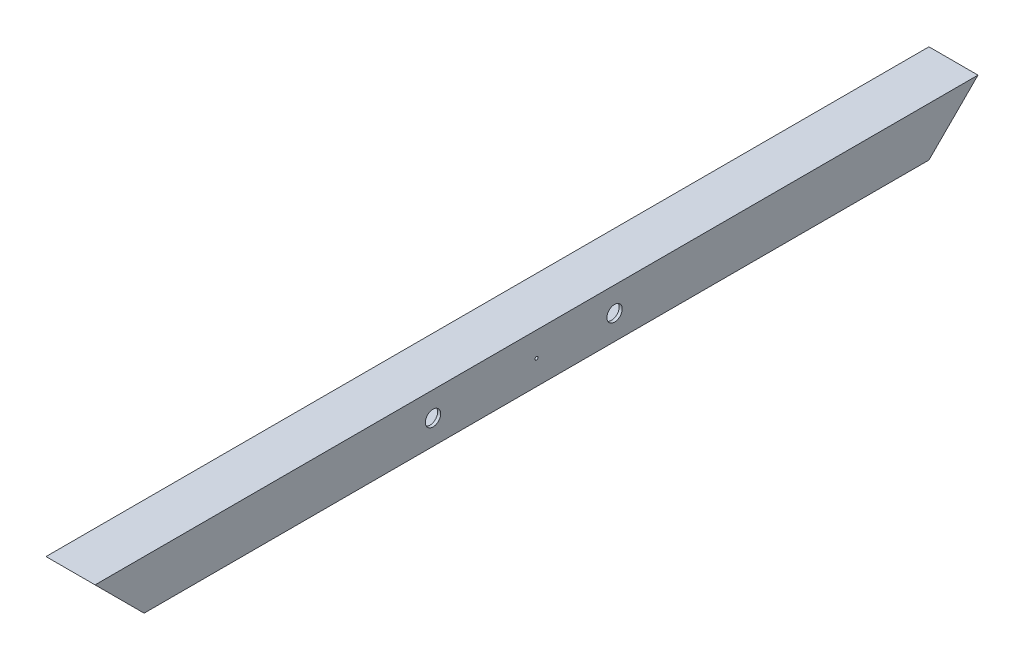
ISO-10303-21;
HEADER;
FILE_DESCRIPTION(('STEP AP214'),'2;1');
FILE_NAME('part.step','',(''),(''),'','','');
FILE_SCHEMA(('AUTOMOTIVE_DESIGN { 1 0 10303 214 1 1 1 1 }'));
ENDSEC;
DATA;
#1=APPLICATION_CONTEXT('core data for automotive mechanical design processes');
#2=APPLICATION_PROTOCOL_DEFINITION('international standard','automotive_design',2000,#1);
#3=PRODUCT_CONTEXT('',#1,'mechanical');
#4=PRODUCT('Part','Part','',(#3));
#5=PRODUCT_RELATED_PRODUCT_CATEGORY('part','',(#4));
#6=PRODUCT_DEFINITION_FORMATION('','',#4);
#7=PRODUCT_DEFINITION_CONTEXT('part definition',#1,'design');
#8=PRODUCT_DEFINITION('design','',#6,#7);
#9=PRODUCT_DEFINITION_SHAPE('','',#8);
#10=(LENGTH_UNIT() NAMED_UNIT(*) SI_UNIT(.MILLI.,.METRE.));
#11=(NAMED_UNIT(*) PLANE_ANGLE_UNIT() SI_UNIT($,.RADIAN.));
#12=(NAMED_UNIT(*) SI_UNIT($,.STERADIAN.) SOLID_ANGLE_UNIT());
#13=UNCERTAINTY_MEASURE_WITH_UNIT(LENGTH_MEASURE(1.E-05),#10,'distance_accuracy_value','');
#14=(GEOMETRIC_REPRESENTATION_CONTEXT(3) GLOBAL_UNCERTAINTY_ASSIGNED_CONTEXT((#13)) GLOBAL_UNIT_ASSIGNED_CONTEXT((#10,
#11,#12)) REPRESENTATION_CONTEXT('',''));
#15=CARTESIAN_POINT('',(0.,0.,0.));
#16=DIRECTION('',(0.,0.,1.));
#17=DIRECTION('',(1.,0.,0.));
#18=AXIS2_PLACEMENT_3D('',#15,#16,#17);
#19=CARTESIAN_POINT('',(-25.4000000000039,-25.4000000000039,-914.4));
#20=DIRECTION('',(-1.00000000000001,0.,0.));
#21=DIRECTION('',(0.,0.,1.));
#22=AXIS2_PLACEMENT_3D('',#19,#20,#21);
#23=PLANE('',#22);
#24=CARTESIAN_POINT('',(-25.4000000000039,-3.99680288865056E-12,-457.2));
#25=DIRECTION('',(-1.00000000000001,0.,0.));
#26=DIRECTION('',(0.,0.,1.));
#27=AXIS2_PLACEMENT_3D('',#24,#25,#26);
#28=CIRCLE('',#27,1.58750000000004);
#29=CARTESIAN_POINT('',(-25.4000000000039,-3.99680288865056E-12,-455.6125));
#30=VERTEX_POINT('',#29);
#31=EDGE_CURVE('E235',#30,#30,#28,.T.);
#32=ORIENTED_EDGE('',*,*,#31,.F.);
#33=EDGE_LOOP('',(#32));
#34=FACE_BOUND('',#33,.T.);
#35=CARTESIAN_POINT('',(-25.4000000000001,-3.99680288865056E-12,-350.012));
#36=DIRECTION('',(-1.00000000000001,0.,0.));
#37=DIRECTION('',(0.,0.,1.));
#38=AXIS2_PLACEMENT_3D('',#35,#36,#37);
#39=CIRCLE('',#38,7.93749999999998);
#40=CARTESIAN_POINT('',(-25.4000000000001,-3.99680288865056E-12,-342.0745));
#41=VERTEX_POINT('',#40);
#42=EDGE_CURVE('E150',#41,#41,#39,.T.);
#43=ORIENTED_EDGE('',*,*,#42,.F.);
#44=EDGE_LOOP('',(#43));
#45=FACE_BOUND('',#44,.T.);
#46=CARTESIAN_POINT('',(-25.4000000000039,0.,-538.0228));
#47=DIRECTION('',(-1.00000000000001,0.,0.));
#48=DIRECTION('',(0.,0.,1.));
#49=AXIS2_PLACEMENT_3D('',#46,#47,#48);
#50=CIRCLE('',#49,7.93749999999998);
#51=CARTESIAN_POINT('',(-25.4000000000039,0.,-530.0853));
#52=VERTEX_POINT('',#51);
#53=EDGE_CURVE('E147',#52,#52,#50,.T.);
#54=ORIENTED_EDGE('',*,*,#53,.F.);
#55=EDGE_LOOP('',(#54));
#56=FACE_BOUND('',#55,.T.);
#57=DIRECTION('',(0.,0.,1.));
#58=VECTOR('',#57,1.);
#59=CARTESIAN_POINT('',(-25.4000000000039,-25.4000000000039,-914.4));
#60=LINE('',#59,#58);
#61=CARTESIAN_POINT('',(-25.4000000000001,-25.4000000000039,-863.6));
#62=VERTEX_POINT('',#61);
#63=CARTESIAN_POINT('',(-25.4000000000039,-25.4000000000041,-50.8000000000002));
#64=VERTEX_POINT('',#63);
#65=EDGE_CURVE('E116',#62,#64,#60,.T.);
#66=ORIENTED_EDGE('',*,*,#65,.T.);
#67=DIRECTION('',(0.,0.707106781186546,0.707106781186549));
#68=VECTOR('',#67,1.);
#69=CARTESIAN_POINT('',(-25.4000000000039,-457.2,-482.600000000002));
#70=LINE('',#69,#68);
#71=CARTESIAN_POINT('',(-25.4000000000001,25.4000000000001,1.99840144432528E-12));
#72=VERTEX_POINT('',#71);
#73=EDGE_CURVE('E115',#64,#72,#70,.T.);
#74=ORIENTED_EDGE('',*,*,#73,.T.);
#75=DIRECTION('',(0.,0.,1.));
#76=VECTOR('',#75,1.);
#77=CARTESIAN_POINT('',(-25.4000000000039,25.3999999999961,-914.4));
#78=LINE('',#77,#76);
#79=CARTESIAN_POINT('',(-25.4000000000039,25.3999999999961,-914.4));
#80=VERTEX_POINT('',#79);
#81=EDGE_CURVE('E103',#80,#72,#78,.T.);
#82=ORIENTED_EDGE('',*,*,#81,.F.);
#83=DIRECTION('',(0.,0.707106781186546,-0.70710678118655));
#84=VECTOR('',#83,1.);
#85=CARTESIAN_POINT('',(-25.4000000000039,2.22044604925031E-13,-889.));
#86=LINE('',#85,#84);
#87=EDGE_CURVE('E190',#62,#80,#86,.T.);
#88=ORIENTED_EDGE('',*,*,#87,.F.);
#89=EDGE_LOOP('',(#66,#74,#82,#88));
#90=FACE_BOUND('',#89,.T.);
#91=ADVANCED_FACE('F34',(#34,#45,#56,#90),#23,.T.);
#92=CARTESIAN_POINT('',(25.3999999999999,-25.4000000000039,-914.4));
#93=DIRECTION('',(1.00000000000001,0.,0.));
#94=DIRECTION('',(0.,1.,0.));
#95=AXIS2_PLACEMENT_3D('',#92,#93,#94);
#96=PLANE('',#95);
#97=CARTESIAN_POINT('',(25.3999999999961,-3.99680288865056E-12,-457.2));
#98=DIRECTION('',(-1.00000000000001,0.,0.));
#99=DIRECTION('',(0.,0.,1.));
#100=AXIS2_PLACEMENT_3D('',#97,#98,#99);
#101=CIRCLE('',#100,1.58750000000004);
#102=CARTESIAN_POINT('',(25.3999999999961,-3.99680288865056E-12,-455.6125));
#103=VERTEX_POINT('',#102);
#104=EDGE_CURVE('E361',#103,#103,#101,.T.);
#105=ORIENTED_EDGE('',*,*,#104,.T.);
#106=EDGE_LOOP('',(#105));
#107=FACE_BOUND('',#106,.T.);
#108=CARTESIAN_POINT('',(25.4000000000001,-3.99680288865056E-12,-350.012));
#109=DIRECTION('',(-1.00000000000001,0.,0.));
#110=DIRECTION('',(0.,0.,1.));
#111=AXIS2_PLACEMENT_3D('',#108,#109,#110);
#112=CIRCLE('',#111,7.93749999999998);
#113=CARTESIAN_POINT('',(25.4000000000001,-3.99680288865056E-12,-342.0745));
#114=VERTEX_POINT('',#113);
#115=EDGE_CURVE('E143',#114,#114,#112,.T.);
#116=ORIENTED_EDGE('',*,*,#115,.T.);
#117=EDGE_LOOP('',(#116));
#118=FACE_BOUND('',#117,.T.);
#119=CARTESIAN_POINT('',(25.3999999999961,0.,-538.0228));
#120=DIRECTION('',(-1.00000000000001,0.,0.));
#121=DIRECTION('',(0.,0.,1.));
#122=AXIS2_PLACEMENT_3D('',#119,#120,#121);
#123=CIRCLE('',#122,7.93749999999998);
#124=CARTESIAN_POINT('',(25.3999999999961,0.,-530.0853));
#125=VERTEX_POINT('',#124);
#126=EDGE_CURVE('E139',#125,#125,#123,.T.);
#127=ORIENTED_EDGE('',*,*,#126,.T.);
#128=EDGE_LOOP('',(#127));
#129=FACE_BOUND('',#128,.T.);
#130=DIRECTION('',(0.,0.,1.));
#131=VECTOR('',#130,1.);
#132=CARTESIAN_POINT('',(25.3999999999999,25.3999999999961,-914.4));
#133=LINE('',#132,#131);
#134=CARTESIAN_POINT('',(25.4000000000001,25.3999999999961,-914.4));
#135=VERTEX_POINT('',#134);
#136=CARTESIAN_POINT('',(25.4000000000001,25.4000000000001,0.));
#137=VERTEX_POINT('',#136);
#138=EDGE_CURVE('E112',#135,#137,#133,.T.);
#139=ORIENTED_EDGE('',*,*,#138,.T.);
#140=DIRECTION('',(0.,-0.707106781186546,-0.707106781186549));
#141=VECTOR('',#140,1.);
#142=CARTESIAN_POINT('',(25.3999999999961,-457.2,-482.600000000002));
#143=LINE('',#142,#141);
#144=CARTESIAN_POINT('',(25.3999999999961,-25.4000000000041,-50.8000000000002));
#145=VERTEX_POINT('',#144);
#146=EDGE_CURVE('E58',#137,#145,#143,.T.);
#147=ORIENTED_EDGE('',*,*,#146,.T.);
#148=DIRECTION('',(0.,0.,1.));
#149=VECTOR('',#148,1.);
#150=CARTESIAN_POINT('',(25.3999999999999,-25.4000000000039,-914.4));
#151=LINE('',#150,#149);
#152=CARTESIAN_POINT('',(25.4000000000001,-25.4000000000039,-863.6));
#153=VERTEX_POINT('',#152);
#154=EDGE_CURVE('E131',#153,#145,#151,.T.);
#155=ORIENTED_EDGE('',*,*,#154,.F.);
#156=DIRECTION('',(0.,-0.707106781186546,0.70710678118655));
#157=VECTOR('',#156,1.);
#158=CARTESIAN_POINT('',(25.3999999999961,2.22044604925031E-13,-889.));
#159=LINE('',#158,#157);
#160=EDGE_CURVE('E188',#135,#153,#159,.T.);
#161=ORIENTED_EDGE('',*,*,#160,.F.);
#162=EDGE_LOOP('',(#139,#147,#155,#161));
#163=FACE_BOUND('',#162,.T.);
#164=ADVANCED_FACE('F224',(#107,#118,#129,#163),#96,.T.);
#165=CARTESIAN_POINT('',(-25.4000000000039,-25.4000000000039,-914.4));
#166=DIRECTION('',(0.,-1.,0.));
#167=DIRECTION('',(0.,0.,-1.));
#168=AXIS2_PLACEMENT_3D('',#165,#166,#167);
#169=PLANE('',#168);
#170=ORIENTED_EDGE('',*,*,#154,.T.);
#171=DIRECTION('',(1.00000000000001,0.,0.));
#172=VECTOR('',#171,1.);
#173=CARTESIAN_POINT('',(-1171.92235041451,-25.4000000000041,-50.8000000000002));
#174=LINE('',#173,#172);
#175=EDGE_CURVE('E50',#64,#145,#174,.T.);
#176=ORIENTED_EDGE('',*,*,#175,.F.);
#177=ORIENTED_EDGE('',*,*,#65,.F.);
#178=DIRECTION('',(1.00000000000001,0.,0.));
#179=VECTOR('',#178,1.);
#180=CARTESIAN_POINT('',(-1171.92235041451,-25.4000000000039,-863.6));
#181=LINE('',#180,#179);
#182=EDGE_CURVE('E118',#62,#153,#181,.T.);
#183=ORIENTED_EDGE('',*,*,#182,.T.);
#184=EDGE_LOOP('',(#170,#176,#177,#183));
#185=FACE_BOUND('',#184,.T.);
#186=ADVANCED_FACE('F229',(#185),#169,.T.);
#187=CARTESIAN_POINT('',(-22.2250000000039,-22.2250000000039,-914.4));
#188=DIRECTION('',(0.,-1.,0.));
#189=DIRECTION('',(0.,0.,-1.));
#190=AXIS2_PLACEMENT_3D('',#187,#188,#189);
#191=PLANE('',#190);
#192=DIRECTION('',(-1.00000000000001,0.,0.));
#193=VECTOR('',#192,1.);
#194=CARTESIAN_POINT('',(-22.2250000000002,-22.2249999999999,-47.625));
#195=LINE('',#194,#193);
#196=CARTESIAN_POINT('',(22.2249999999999,-22.2250000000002,-47.6250000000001));
#197=VERTEX_POINT('',#196);
#198=CARTESIAN_POINT('',(-22.2250000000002,-22.2249999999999,-47.6250000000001));
#199=VERTEX_POINT('',#198);
#200=EDGE_CURVE('E173',#197,#199,#195,.T.);
#201=ORIENTED_EDGE('',*,*,#200,.F.);
#202=DIRECTION('',(0.,0.,1.));
#203=VECTOR('',#202,1.);
#204=CARTESIAN_POINT('',(22.2249999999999,-22.2250000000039,-914.4));
#205=LINE('',#204,#203);
#206=CARTESIAN_POINT('',(22.2249999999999,-22.2250000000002,-866.775));
#207=VERTEX_POINT('',#206);
#208=EDGE_CURVE('E191',#207,#197,#205,.T.);
#209=ORIENTED_EDGE('',*,*,#208,.F.);
#210=DIRECTION('',(-1.00000000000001,0.,0.));
#211=VECTOR('',#210,1.);
#212=CARTESIAN_POINT('',(-22.2249999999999,-22.2250000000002,-866.775));
#213=LINE('',#212,#211);
#214=CARTESIAN_POINT('',(-22.2249999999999,-22.2250000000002,-866.775));
#215=VERTEX_POINT('',#214);
#216=EDGE_CURVE('E185',#207,#215,#213,.T.);
#217=ORIENTED_EDGE('',*,*,#216,.T.);
#218=DIRECTION('',(0.,0.,1.));
#219=VECTOR('',#218,1.);
#220=CARTESIAN_POINT('',(-22.2250000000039,-22.2250000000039,-914.4));
#221=LINE('',#220,#219);
#222=EDGE_CURVE('E122',#215,#199,#221,.T.);
#223=ORIENTED_EDGE('',*,*,#222,.T.);
#224=EDGE_LOOP('',(#201,#209,#217,#223));
#225=FACE_BOUND('',#224,.T.);
#226=ADVANCED_FACE('F203',(#225),#191,.F.);
#227=CARTESIAN_POINT('',(-22.2250000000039,-22.2250000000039,-914.4));
#228=DIRECTION('',(-1.00000000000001,0.,0.));
#229=DIRECTION('',(0.,0.,1.));
#230=AXIS2_PLACEMENT_3D('',#227,#228,#229);
#231=PLANE('',#230);
#232=CARTESIAN_POINT('',(-22.2250000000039,-3.99680288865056E-12,-457.2));
#233=DIRECTION('',(-1.00000000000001,0.,0.));
#234=DIRECTION('',(0.,0.,1.));
#235=AXIS2_PLACEMENT_3D('',#232,#233,#234);
#236=CIRCLE('',#235,1.58750000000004);
#237=CARTESIAN_POINT('',(-22.2250000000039,-3.99680288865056E-12,-455.6125));
#238=VERTEX_POINT('',#237);
#239=EDGE_CURVE('E155',#238,#238,#236,.T.);
#240=ORIENTED_EDGE('',*,*,#239,.T.);
#241=EDGE_LOOP('',(#240));
#242=FACE_BOUND('',#241,.T.);
#243=CARTESIAN_POINT('',(-22.2249999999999,-3.99680288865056E-12,-350.012));
#244=DIRECTION('',(-1.00000000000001,0.,0.));
#245=DIRECTION('',(0.,0.,1.));
#246=AXIS2_PLACEMENT_3D('',#243,#244,#245);
#247=CIRCLE('',#246,7.93749999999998);
#248=CARTESIAN_POINT('',(-22.2249999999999,-3.99680288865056E-12,-342.0745));
#249=VERTEX_POINT('',#248);
#250=EDGE_CURVE('E142',#249,#249,#247,.T.);
#251=ORIENTED_EDGE('',*,*,#250,.T.);
#252=EDGE_LOOP('',(#251));
#253=FACE_BOUND('',#252,.T.);
#254=CARTESIAN_POINT('',(-22.2250000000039,0.,-538.0228));
#255=DIRECTION('',(-1.00000000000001,0.,0.));
#256=DIRECTION('',(0.,0.,1.));
#257=AXIS2_PLACEMENT_3D('',#254,#255,#256);
#258=CIRCLE('',#257,7.93749999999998);
#259=CARTESIAN_POINT('',(-22.2250000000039,0.,-530.0853));
#260=VERTEX_POINT('',#259);
#261=EDGE_CURVE('E138',#260,#260,#258,.T.);
#262=ORIENTED_EDGE('',*,*,#261,.T.);
#263=EDGE_LOOP('',(#262));
#264=FACE_BOUND('',#263,.T.);
#265=DIRECTION('',(0.,0.707106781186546,0.707106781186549));
#266=VECTOR('',#265,1.);
#267=CARTESIAN_POINT('',(-22.2250000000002,-455.6125,-481.012500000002));
#268=LINE('',#267,#266);
#269=CARTESIAN_POINT('',(-22.2250000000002,22.2249999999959,-3.17499999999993));
#270=VERTEX_POINT('',#269);
#271=EDGE_CURVE('E170',#199,#270,#268,.T.);
#272=ORIENTED_EDGE('',*,*,#271,.F.);
#273=ORIENTED_EDGE('',*,*,#222,.F.);
#274=DIRECTION('',(0.,0.707106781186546,-0.70710678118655));
#275=VECTOR('',#274,1.);
#276=CARTESIAN_POINT('',(-22.2249999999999,1.58750000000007,-890.5875));
#277=LINE('',#276,#275);
#278=CARTESIAN_POINT('',(-22.2250000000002,22.2249999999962,-911.225));
#279=VERTEX_POINT('',#278);
#280=EDGE_CURVE('E182',#215,#279,#277,.T.);
#281=ORIENTED_EDGE('',*,*,#280,.T.);
#282=DIRECTION('',(0.,0.,1.));
#283=VECTOR('',#282,1.);
#284=CARTESIAN_POINT('',(-22.2250000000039,22.2249999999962,-914.4));
#285=LINE('',#284,#283);
#286=EDGE_CURVE('E126',#279,#270,#285,.T.);
#287=ORIENTED_EDGE('',*,*,#286,.T.);
#288=EDGE_LOOP('',(#272,#273,#281,#287));
#289=FACE_BOUND('',#288,.T.);
#290=ADVANCED_FACE('F209',(#242,#253,#264,#289),#231,.F.);
#291=CARTESIAN_POINT('',(-22.2250000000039,22.2249999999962,-914.4));
#292=DIRECTION('',(0.,1.,0.));
#293=DIRECTION('',(-1.00000000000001,0.,0.));
#294=AXIS2_PLACEMENT_3D('',#291,#292,#293);
#295=PLANE('',#294);
#296=DIRECTION('',(1.00000000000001,0.,0.));
#297=VECTOR('',#296,1.);
#298=CARTESIAN_POINT('',(-22.2250000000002,22.2249999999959,-3.17499999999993));
#299=LINE('',#298,#297);
#300=CARTESIAN_POINT('',(22.2249999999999,22.2249999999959,-3.17499999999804));
#301=VERTEX_POINT('',#300);
#302=EDGE_CURVE('E167',#270,#301,#299,.T.);
#303=ORIENTED_EDGE('',*,*,#302,.F.);
#304=ORIENTED_EDGE('',*,*,#286,.F.);
#305=DIRECTION('',(1.00000000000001,0.,0.));
#306=VECTOR('',#305,1.);
#307=CARTESIAN_POINT('',(-22.2250000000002,22.2249999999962,-911.225));
#308=LINE('',#307,#306);
#309=CARTESIAN_POINT('',(22.2249999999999,22.2249999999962,-911.225));
#310=VERTEX_POINT('',#309);
#311=EDGE_CURVE('E179',#279,#310,#308,.T.);
#312=ORIENTED_EDGE('',*,*,#311,.T.);
#313=DIRECTION('',(0.,0.,1.));
#314=VECTOR('',#313,1.);
#315=CARTESIAN_POINT('',(22.2249999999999,22.2249999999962,-914.4));
#316=LINE('',#315,#314);
#317=EDGE_CURVE('E195',#310,#301,#316,.T.);
#318=ORIENTED_EDGE('',*,*,#317,.T.);
#319=EDGE_LOOP('',(#303,#304,#312,#318));
#320=FACE_BOUND('',#319,.T.);
#321=ADVANCED_FACE('F207',(#320),#295,.F.);
#322=CARTESIAN_POINT('',(22.2249999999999,-22.2250000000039,-914.4));
#323=DIRECTION('',(1.00000000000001,0.,0.));
#324=DIRECTION('',(0.,0.,-1.));
#325=AXIS2_PLACEMENT_3D('',#322,#323,#324);
#326=PLANE('',#325);
#327=CARTESIAN_POINT('',(22.2249999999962,-3.99680288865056E-12,-457.2));
#328=DIRECTION('',(1.00000000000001,0.,0.));
#329=DIRECTION('',(0.,0.,-1.));
#330=AXIS2_PLACEMENT_3D('',#327,#328,#329);
#331=CIRCLE('',#330,1.58750000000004);
#332=CARTESIAN_POINT('',(22.2249999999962,-3.99680288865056E-12,-458.7875));
#333=VERTEX_POINT('',#332);
#334=EDGE_CURVE('E37',#333,#333,#331,.T.);
#335=ORIENTED_EDGE('',*,*,#334,.T.);
#336=EDGE_LOOP('',(#335));
#337=FACE_BOUND('',#336,.T.);
#338=CARTESIAN_POINT('',(22.2249999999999,-3.99680288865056E-12,-350.012));
#339=DIRECTION('',(1.00000000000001,0.,0.));
#340=DIRECTION('',(0.,0.,-1.));
#341=AXIS2_PLACEMENT_3D('',#338,#339,#340);
#342=CIRCLE('',#341,7.93749999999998);
#343=CARTESIAN_POINT('',(22.2249999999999,-3.99680288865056E-12,-357.9495));
#344=VERTEX_POINT('',#343);
#345=EDGE_CURVE('E140',#344,#344,#342,.T.);
#346=ORIENTED_EDGE('',*,*,#345,.T.);
#347=EDGE_LOOP('',(#346));
#348=FACE_BOUND('',#347,.T.);
#349=CARTESIAN_POINT('',(22.2249999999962,0.,-538.0228));
#350=DIRECTION('',(1.00000000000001,0.,0.));
#351=DIRECTION('',(0.,0.,-1.));
#352=AXIS2_PLACEMENT_3D('',#349,#350,#351);
#353=CIRCLE('',#352,7.93749999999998);
#354=CARTESIAN_POINT('',(22.2249999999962,0.,-545.9603));
#355=VERTEX_POINT('',#354);
#356=EDGE_CURVE('E136',#355,#355,#353,.T.);
#357=ORIENTED_EDGE('',*,*,#356,.T.);
#358=EDGE_LOOP('',(#357));
#359=FACE_BOUND('',#358,.T.);
#360=DIRECTION('',(0.,-0.707106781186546,-0.707106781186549));
#361=VECTOR('',#360,1.);
#362=CARTESIAN_POINT('',(22.2249999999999,-455.6125,-481.012500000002));
#363=LINE('',#362,#361);
#364=EDGE_CURVE('E11',#301,#197,#363,.T.);
#365=ORIENTED_EDGE('',*,*,#364,.F.);
#366=ORIENTED_EDGE('',*,*,#317,.F.);
#367=DIRECTION('',(0.,-0.707106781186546,0.70710678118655));
#368=VECTOR('',#367,1.);
#369=CARTESIAN_POINT('',(22.2249999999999,1.58750000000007,-890.5875));
#370=LINE('',#369,#368);
#371=EDGE_CURVE('E42',#310,#207,#370,.T.);
#372=ORIENTED_EDGE('',*,*,#371,.T.);
#373=ORIENTED_EDGE('',*,*,#208,.T.);
#374=EDGE_LOOP('',(#365,#366,#372,#373));
#375=FACE_BOUND('',#374,.T.);
#376=ADVANCED_FACE('F200',(#337,#348,#359,#375),#326,.F.);
#377=CARTESIAN_POINT('',(-25.4000000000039,25.3999999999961,-914.4));
#378=DIRECTION('',(0.,1.,0.));
#379=DIRECTION('',(0.,0.,1.));
#380=AXIS2_PLACEMENT_3D('',#377,#378,#379);
#381=PLANE('',#380);
#382=DIRECTION('',(-1.00000000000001,0.,0.));
#383=VECTOR('',#382,1.);
#384=CARTESIAN_POINT('',(-25.4000000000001,25.4000000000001,1.99840144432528E-12));
#385=LINE('',#384,#383);
#386=EDGE_CURVE('E108',#137,#72,#385,.T.);
#387=ORIENTED_EDGE('',*,*,#386,.F.);
#388=ORIENTED_EDGE('',*,*,#138,.F.);
#389=DIRECTION('',(-1.00000000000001,0.,0.));
#390=VECTOR('',#389,1.);
#391=CARTESIAN_POINT('',(-25.4000000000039,25.3999999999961,-914.4));
#392=LINE('',#391,#390);
#393=EDGE_CURVE('E109',#135,#80,#392,.T.);
#394=ORIENTED_EDGE('',*,*,#393,.T.);
#395=ORIENTED_EDGE('',*,*,#81,.T.);
#396=EDGE_LOOP('',(#387,#388,#394,#395));
#397=FACE_BOUND('',#396,.T.);
#398=ADVANCED_FACE('F105',(#397),#381,.T.);
#399=CARTESIAN_POINT('',(-1171.92235041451,25.3999999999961,-914.4));
#400=DIRECTION('',(0.,0.707106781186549,0.707106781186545));
#401=DIRECTION('',(0.,-0.707106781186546,0.70710678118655));
#402=AXIS2_PLACEMENT_3D('',#399,#400,#401);
#403=PLANE('',#402);
#404=ORIENTED_EDGE('',*,*,#182,.F.);
#405=ORIENTED_EDGE('',*,*,#87,.T.);
#406=ORIENTED_EDGE('',*,*,#393,.F.);
#407=ORIENTED_EDGE('',*,*,#160,.T.);
#408=EDGE_LOOP('',(#404,#405,#406,#407));
#409=FACE_BOUND('',#408,.T.);
#410=ORIENTED_EDGE('',*,*,#216,.F.);
#411=ORIENTED_EDGE('',*,*,#371,.F.);
#412=ORIENTED_EDGE('',*,*,#311,.F.);
#413=ORIENTED_EDGE('',*,*,#280,.F.);
#414=EDGE_LOOP('',(#410,#411,#412,#413));
#415=FACE_BOUND('',#414,.T.);
#416=ADVANCED_FACE('F211',(#409,#415),#403,.F.);
#417=CARTESIAN_POINT('',(-1171.92235041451,25.4000000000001,1.99840144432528E-12));
#418=DIRECTION('',(0.,-0.707106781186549,0.707106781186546));
#419=DIRECTION('',(0.,-0.707106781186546,-0.707106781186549));
#420=AXIS2_PLACEMENT_3D('',#417,#418,#419);
#421=PLANE('',#420);
#422=ORIENTED_EDGE('',*,*,#73,.F.);
#423=ORIENTED_EDGE('',*,*,#175,.T.);
#424=ORIENTED_EDGE('',*,*,#146,.F.);
#425=ORIENTED_EDGE('',*,*,#386,.T.);
#426=EDGE_LOOP('',(#422,#423,#424,#425));
#427=FACE_BOUND('',#426,.T.);
#428=ORIENTED_EDGE('',*,*,#364,.T.);
#429=ORIENTED_EDGE('',*,*,#200,.T.);
#430=ORIENTED_EDGE('',*,*,#271,.T.);
#431=ORIENTED_EDGE('',*,*,#302,.T.);
#432=EDGE_LOOP('',(#428,#429,#430,#431));
#433=FACE_BOUND('',#432,.T.);
#434=ADVANCED_FACE('F120',(#427,#433),#421,.T.);
#435=CARTESIAN_POINT('',(25.3999999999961,0.,-538.0228));
#436=DIRECTION('',(-1.00000000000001,0.,0.));
#437=DIRECTION('',(0.,0.,1.));
#438=AXIS2_PLACEMENT_3D('',#435,#436,#437);
#439=CYLINDRICAL_SURFACE('',#438,7.93749999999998);
#440=ORIENTED_EDGE('',*,*,#126,.F.);
#441=EDGE_LOOP('',(#440));
#442=FACE_BOUND('',#441,.T.);
#443=ORIENTED_EDGE('',*,*,#356,.F.);
#444=EDGE_LOOP('',(#443));
#445=FACE_BOUND('',#444,.T.);
#446=ADVANCED_FACE('F219',(#442,#445),#439,.F.);
#447=ORIENTED_EDGE('',*,*,#53,.T.);
#448=EDGE_LOOP('',(#447));
#449=FACE_BOUND('',#448,.T.);
#450=ORIENTED_EDGE('',*,*,#261,.F.);
#451=EDGE_LOOP('',(#450));
#452=FACE_BOUND('',#451,.T.);
#453=ADVANCED_FACE('F240',(#449,#452),#439,.F.);
#454=CARTESIAN_POINT('',(25.4000000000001,-3.99680288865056E-12,-350.012));
#455=DIRECTION('',(-1.00000000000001,0.,0.));
#456=DIRECTION('',(0.,0.,1.));
#457=AXIS2_PLACEMENT_3D('',#454,#455,#456);
#458=CYLINDRICAL_SURFACE('',#457,7.93749999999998);
#459=ORIENTED_EDGE('',*,*,#115,.F.);
#460=EDGE_LOOP('',(#459));
#461=FACE_BOUND('',#460,.T.);
#462=ORIENTED_EDGE('',*,*,#345,.F.);
#463=EDGE_LOOP('',(#462));
#464=FACE_BOUND('',#463,.T.);
#465=ADVANCED_FACE('F243',(#461,#464),#458,.F.);
#466=ORIENTED_EDGE('',*,*,#42,.T.);
#467=EDGE_LOOP('',(#466));
#468=FACE_BOUND('',#467,.T.);
#469=ORIENTED_EDGE('',*,*,#250,.F.);
#470=EDGE_LOOP('',(#469));
#471=FACE_BOUND('',#470,.T.);
#472=ADVANCED_FACE('F326',(#468,#471),#458,.F.);
#473=CARTESIAN_POINT('',(25.3999999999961,-3.99680288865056E-12,-457.2));
#474=DIRECTION('',(-1.00000000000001,0.,0.));
#475=DIRECTION('',(0.,0.,1.));
#476=AXIS2_PLACEMENT_3D('',#473,#474,#475);
#477=CYLINDRICAL_SURFACE('',#476,1.58750000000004);
#478=ORIENTED_EDGE('',*,*,#104,.F.);
#479=EDGE_LOOP('',(#478));
#480=FACE_BOUND('',#479,.T.);
#481=ORIENTED_EDGE('',*,*,#334,.F.);
#482=EDGE_LOOP('',(#481));
#483=FACE_BOUND('',#482,.T.);
#484=ADVANCED_FACE('F336',(#480,#483),#477,.F.);
#485=ORIENTED_EDGE('',*,*,#31,.T.);
#486=EDGE_LOOP('',(#485));
#487=FACE_BOUND('',#486,.T.);
#488=ORIENTED_EDGE('',*,*,#239,.F.);
#489=EDGE_LOOP('',(#488));
#490=FACE_BOUND('',#489,.T.);
#491=ADVANCED_FACE('F345',(#487,#490),#477,.F.);
#492=CLOSED_SHELL('',(#91,#164,#186,#226,#290,#321,#376,#398,#416,#434,#446,#453,#465,#472,#484,#491));
#493=MANIFOLD_SOLID_BREP('B2',#492);
#494=ADVANCED_BREP_SHAPE_REPRESENTATION('',(#18,#493),#14);
#495=SHAPE_DEFINITION_REPRESENTATION(#9,#494);
ENDSEC;
END-ISO-10303-21;
